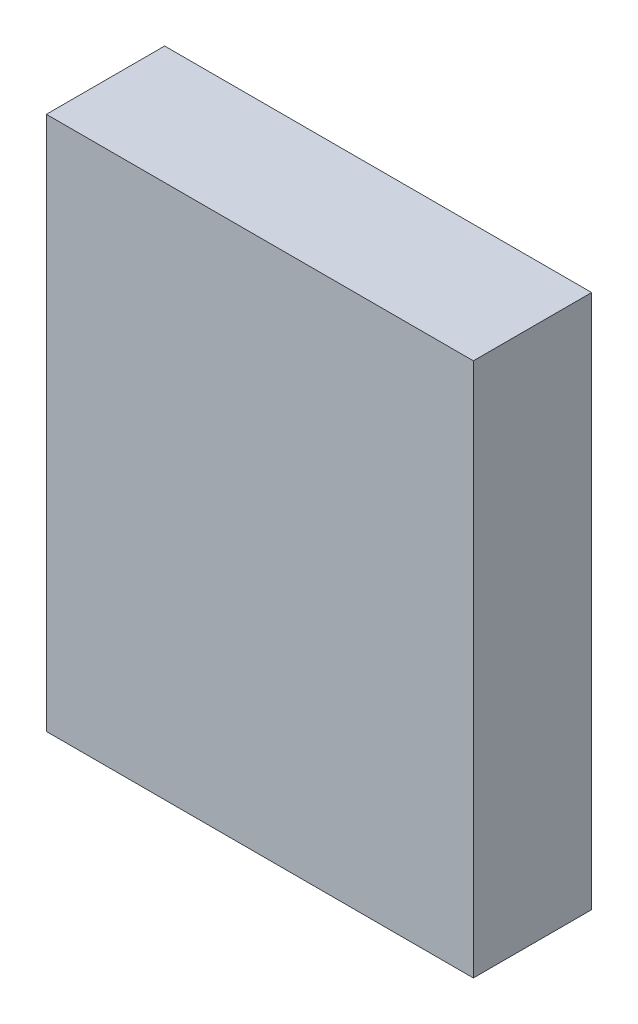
ISO-10303-21;
HEADER;
FILE_DESCRIPTION(('STEP AP214'),'2;1');
FILE_NAME('part.step','',(''),(''),'','','');
FILE_SCHEMA(('AUTOMOTIVE_DESIGN { 1 0 10303 214 1 1 1 1 }'));
ENDSEC;
DATA;
#1=APPLICATION_CONTEXT('core data for automotive mechanical design processes');
#2=APPLICATION_PROTOCOL_DEFINITION('international standard','automotive_design',2000,#1);
#3=PRODUCT_CONTEXT('',#1,'mechanical');
#4=PRODUCT('Part','Part','',(#3));
#5=PRODUCT_RELATED_PRODUCT_CATEGORY('part','',(#4));
#6=PRODUCT_DEFINITION_FORMATION('','',#4);
#7=PRODUCT_DEFINITION_CONTEXT('part definition',#1,'design');
#8=PRODUCT_DEFINITION('design','',#6,#7);
#9=PRODUCT_DEFINITION_SHAPE('','',#8);
#10=(LENGTH_UNIT() NAMED_UNIT(*) SI_UNIT(.MILLI.,.METRE.));
#11=(NAMED_UNIT(*) PLANE_ANGLE_UNIT() SI_UNIT($,.RADIAN.));
#12=(NAMED_UNIT(*) SI_UNIT($,.STERADIAN.) SOLID_ANGLE_UNIT());
#13=UNCERTAINTY_MEASURE_WITH_UNIT(LENGTH_MEASURE(1.E-05),#10,'distance_accuracy_value','');
#14=(GEOMETRIC_REPRESENTATION_CONTEXT(3) GLOBAL_UNCERTAINTY_ASSIGNED_CONTEXT((#13)) GLOBAL_UNIT_ASSIGNED_CONTEXT((#10,
#11,#12)) REPRESENTATION_CONTEXT('',''));
#15=CARTESIAN_POINT('',(0.,0.,0.));
#16=DIRECTION('',(0.,0.,1.));
#17=DIRECTION('',(1.,0.,0.));
#18=AXIS2_PLACEMENT_3D('',#15,#16,#17);
#19=CARTESIAN_POINT('',(-35.3457831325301,33.4222030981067,19.05));
#20=DIRECTION('',(1.,0.,0.));
#21=DIRECTION('',(0.,0.,-1.));
#22=AXIS2_PLACEMENT_3D('',#19,#20,#21);
#23=PLANE('',#22);
#24=DIRECTION('',(0.,-1.,0.));
#25=VECTOR('',#24,1.);
#26=CARTESIAN_POINT('',(-35.3457831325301,33.4222030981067,0.));
#27=LINE('',#26,#25);
#28=CARTESIAN_POINT('',(-35.3457831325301,33.4222030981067,0.));
#29=VERTEX_POINT('',#28);
#30=CARTESIAN_POINT('',(-35.3457831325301,-52.6580034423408,0.));
#31=VERTEX_POINT('',#30);
#32=EDGE_CURVE('E94',#29,#31,#27,.T.);
#33=ORIENTED_EDGE('',*,*,#32,.T.);
#34=DIRECTION('',(0.,0.,-1.));
#35=VECTOR('',#34,1.);
#36=CARTESIAN_POINT('',(-35.3457831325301,-52.6580034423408,19.05));
#37=LINE('',#36,#35);
#38=CARTESIAN_POINT('',(-35.3457831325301,-52.6580034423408,19.05));
#39=VERTEX_POINT('',#38);
#40=EDGE_CURVE('E11',#39,#31,#37,.T.);
#41=ORIENTED_EDGE('',*,*,#40,.F.);
#42=DIRECTION('',(0.,-1.,0.));
#43=VECTOR('',#42,1.);
#44=CARTESIAN_POINT('',(-35.3457831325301,33.4222030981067,19.05));
#45=LINE('',#44,#43);
#46=CARTESIAN_POINT('',(-35.3457831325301,33.4222030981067,19.05));
#47=VERTEX_POINT('',#46);
#48=EDGE_CURVE('E82',#47,#39,#45,.T.);
#49=ORIENTED_EDGE('',*,*,#48,.F.);
#50=DIRECTION('',(0.,0.,-1.));
#51=VECTOR('',#50,1.);
#52=CARTESIAN_POINT('',(-35.3457831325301,33.4222030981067,19.05));
#53=LINE('',#52,#51);
#54=EDGE_CURVE('E90',#47,#29,#53,.T.);
#55=ORIENTED_EDGE('',*,*,#54,.T.);
#56=EDGE_LOOP('',(#33,#41,#49,#55));
#57=FACE_BOUND('',#56,.T.);
#58=ADVANCED_FACE('F31',(#57),#23,.F.);
#59=CARTESIAN_POINT('',(-35.3457831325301,-52.6580034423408,19.05));
#60=DIRECTION('',(0.,1.,0.));
#61=DIRECTION('',(0.,0.,1.));
#62=AXIS2_PLACEMENT_3D('',#59,#60,#61);
#63=PLANE('',#62);
#64=DIRECTION('',(1.,0.,0.));
#65=VECTOR('',#64,1.);
#66=CARTESIAN_POINT('',(-35.3457831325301,-52.6580034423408,0.));
#67=LINE('',#66,#65);
#68=CARTESIAN_POINT('',(33.4222030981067,-52.6580034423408,0.));
#69=VERTEX_POINT('',#68);
#70=EDGE_CURVE('E86',#31,#69,#67,.T.);
#71=ORIENTED_EDGE('',*,*,#70,.T.);
#72=DIRECTION('',(0.,0.,-1.));
#73=VECTOR('',#72,1.);
#74=CARTESIAN_POINT('',(33.4222030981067,-52.6580034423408,19.05));
#75=LINE('',#74,#73);
#76=CARTESIAN_POINT('',(33.4222030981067,-52.6580034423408,19.05));
#77=VERTEX_POINT('',#76);
#78=EDGE_CURVE('E39',#77,#69,#75,.T.);
#79=ORIENTED_EDGE('',*,*,#78,.F.);
#80=DIRECTION('',(1.,0.,0.));
#81=VECTOR('',#80,1.);
#82=CARTESIAN_POINT('',(-35.3457831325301,-52.6580034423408,19.05));
#83=LINE('',#82,#81);
#84=EDGE_CURVE('E77',#39,#77,#83,.T.);
#85=ORIENTED_EDGE('',*,*,#84,.F.);
#86=ORIENTED_EDGE('',*,*,#40,.T.);
#87=EDGE_LOOP('',(#71,#79,#85,#86));
#88=FACE_BOUND('',#87,.T.);
#89=ADVANCED_FACE('F85',(#88),#63,.F.);
#90=CARTESIAN_POINT('',(33.4222030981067,33.4222030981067,19.05));
#91=DIRECTION('',(-1.,0.,0.));
#92=DIRECTION('',(0.,0.,1.));
#93=AXIS2_PLACEMENT_3D('',#90,#91,#92);
#94=PLANE('',#93);
#95=DIRECTION('',(0.,1.,0.));
#96=VECTOR('',#95,1.);
#97=CARTESIAN_POINT('',(33.4222030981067,33.4222030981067,0.));
#98=LINE('',#97,#96);
#99=CARTESIAN_POINT('',(33.4222030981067,33.4222030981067,0.));
#100=VERTEX_POINT('',#99);
#101=EDGE_CURVE('E64',#69,#100,#98,.T.);
#102=ORIENTED_EDGE('',*,*,#101,.T.);
#103=DIRECTION('',(0.,0.,-1.));
#104=VECTOR('',#103,1.);
#105=CARTESIAN_POINT('',(33.4222030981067,33.4222030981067,19.05));
#106=LINE('',#105,#104);
#107=CARTESIAN_POINT('',(33.4222030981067,33.4222030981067,19.05));
#108=VERTEX_POINT('',#107);
#109=EDGE_CURVE('E87',#108,#100,#106,.T.);
#110=ORIENTED_EDGE('',*,*,#109,.F.);
#111=DIRECTION('',(0.,1.,0.));
#112=VECTOR('',#111,1.);
#113=CARTESIAN_POINT('',(33.4222030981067,33.4222030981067,19.05));
#114=LINE('',#113,#112);
#115=EDGE_CURVE('E80',#77,#108,#114,.T.);
#116=ORIENTED_EDGE('',*,*,#115,.F.);
#117=ORIENTED_EDGE('',*,*,#78,.T.);
#118=EDGE_LOOP('',(#102,#110,#116,#117));
#119=FACE_BOUND('',#118,.T.);
#120=ADVANCED_FACE('F88',(#119),#94,.F.);
#121=CARTESIAN_POINT('',(-35.3457831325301,33.4222030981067,19.05));
#122=DIRECTION('',(0.,-1.,0.));
#123=DIRECTION('',(0.,0.,-1.));
#124=AXIS2_PLACEMENT_3D('',#121,#122,#123);
#125=PLANE('',#124);
#126=DIRECTION('',(-1.,0.,0.));
#127=VECTOR('',#126,1.);
#128=CARTESIAN_POINT('',(-35.3457831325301,33.4222030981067,0.));
#129=LINE('',#128,#127);
#130=EDGE_CURVE('E70',#100,#29,#129,.T.);
#131=ORIENTED_EDGE('',*,*,#130,.T.);
#132=ORIENTED_EDGE('',*,*,#54,.F.);
#133=DIRECTION('',(-1.,0.,0.));
#134=VECTOR('',#133,1.);
#135=CARTESIAN_POINT('',(-35.3457831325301,33.4222030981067,19.05));
#136=LINE('',#135,#134);
#137=EDGE_CURVE('E47',#108,#47,#136,.T.);
#138=ORIENTED_EDGE('',*,*,#137,.F.);
#139=ORIENTED_EDGE('',*,*,#109,.T.);
#140=EDGE_LOOP('',(#131,#132,#138,#139));
#141=FACE_BOUND('',#140,.T.);
#142=ADVANCED_FACE('F101',(#141),#125,.F.);
#143=CARTESIAN_POINT('',(-35.3457831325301,-52.6580034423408,19.05));
#144=DIRECTION('',(0.,0.,1.));
#145=DIRECTION('',(1.,0.,0.));
#146=AXIS2_PLACEMENT_3D('',#143,#144,#145);
#147=PLANE('',#146);
#148=ORIENTED_EDGE('',*,*,#48,.T.);
#149=ORIENTED_EDGE('',*,*,#84,.T.);
#150=ORIENTED_EDGE('',*,*,#115,.T.);
#151=ORIENTED_EDGE('',*,*,#137,.T.);
#152=EDGE_LOOP('',(#148,#149,#150,#151));
#153=FACE_BOUND('',#152,.T.);
#154=ADVANCED_FACE('F78',(#153),#147,.T.);
#155=CARTESIAN_POINT('',(-35.3457831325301,-52.6580034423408,0.));
#156=DIRECTION('',(0.,0.,1.));
#157=DIRECTION('',(1.,0.,0.));
#158=AXIS2_PLACEMENT_3D('',#155,#156,#157);
#159=PLANE('',#158);
#160=ORIENTED_EDGE('',*,*,#32,.F.);
#161=ORIENTED_EDGE('',*,*,#130,.F.);
#162=ORIENTED_EDGE('',*,*,#101,.F.);
#163=ORIENTED_EDGE('',*,*,#70,.F.);
#164=EDGE_LOOP('',(#160,#161,#162,#163));
#165=FACE_BOUND('',#164,.T.);
#166=ADVANCED_FACE('F104',(#165),#159,.F.);
#167=CLOSED_SHELL('',(#58,#89,#120,#142,#154,#166));
#168=MANIFOLD_SOLID_BREP('B2',#167);
#169=ADVANCED_BREP_SHAPE_REPRESENTATION('',(#18,#168),#14);
#170=SHAPE_DEFINITION_REPRESENTATION(#9,#169);
ENDSEC;
END-ISO-10303-21;
